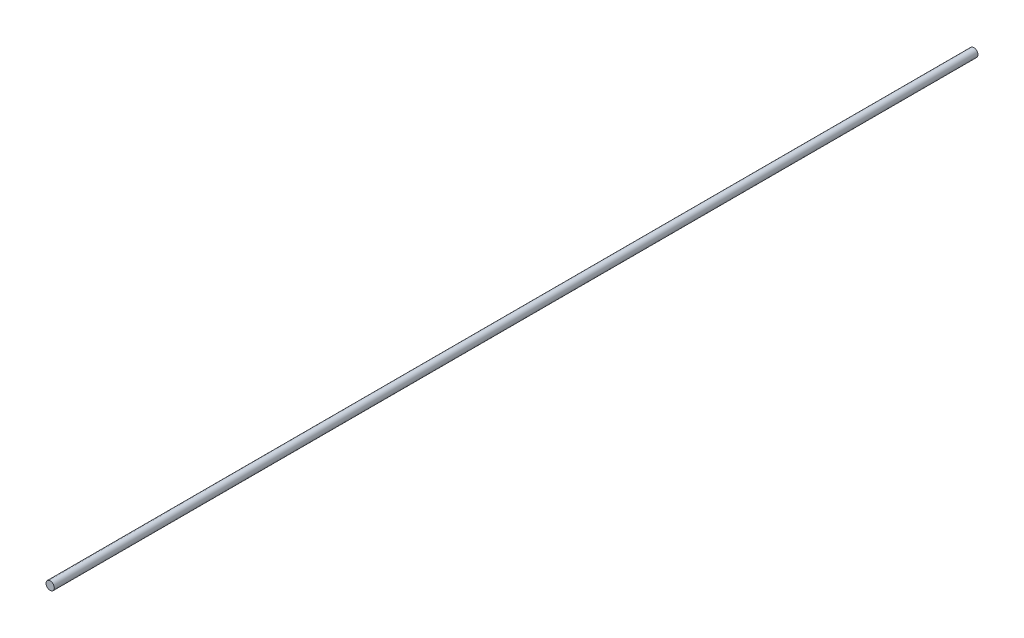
from build123d import *

# Parameters (mm, degrees)
ESQUISSE1_R      = 9
EXTRUSION1_DEPTH = 2000


with BuildPart() as part:
    # Esquisse1 → Extrusion1 (new body)
    with BuildSketch(Plane.XY):
        Circle(ESQUISSE1_R)
    extrude(amount=EXTRUSION1_DEPTH)


solid = part.part
